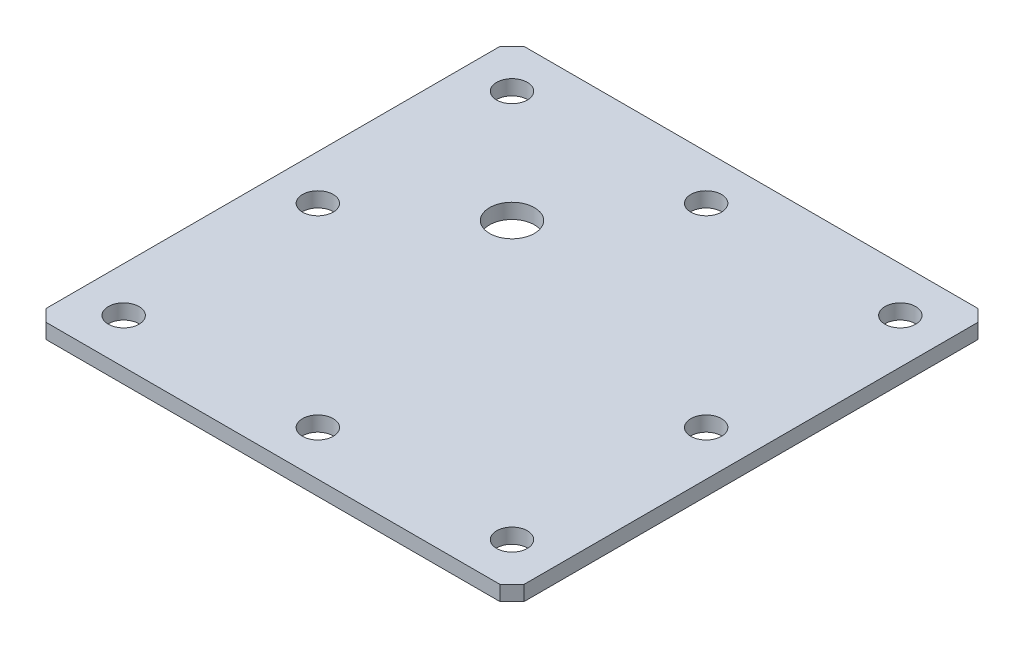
from build123d import *

# Parameters (mm, degrees)
SKETCH1_R           = 3.2639
SKETCH1_R_2         = 4.7625
BOSS_EXTRUDE1_DEPTH = 3.175


with BuildPart() as part:
    # Sketch1 → Boss-Extrude1 (new body)
    with BuildSketch(Plane(origin=(0, 0, 0), x_dir=(1, 0, 0), z_dir=(0, 1, 0))):
        Polygon((-49.428015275, 48.634177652), (-46.888015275, 51.174177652), (49.631984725, 51.174177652), (52.171984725, 48.634177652), (52.171984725, -47.885822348), (49.631984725, -50.425822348), (-46.888015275, -50.425822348), (-49.428015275, -47.885822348), align=None)
        with Locations(Location((-39.903015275, 41.649177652, 0), (0, 0, 270))):
            Circle(SKETCH1_R, mode=Mode.SUBTRACT)
        with Locations(Location((1.371984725, 41.649177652, 0), (0, 0, 270))):
            Circle(SKETCH1_R, mode=Mode.SUBTRACT)
        with Locations(Location((42.646984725, 41.649177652, 0), (0, 0, 270))):
            Circle(SKETCH1_R, mode=Mode.SUBTRACT)
        with Locations(Location((42.646984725, 0.374177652, 0), (0, 0, 270))):
            Circle(SKETCH1_R, mode=Mode.SUBTRACT)
        with Locations(Location((42.646984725, -40.900822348, 0), (0, 0, 270))):
            Circle(SKETCH1_R, mode=Mode.SUBTRACT)
        with Locations(Location((1.371984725, -40.900822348, 0), (0, 0, 270))):
            Circle(SKETCH1_R, mode=Mode.SUBTRACT)
        with Locations(Location((-39.903015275, -40.900822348, 0), (0, 0, 270))):
            Circle(SKETCH1_R, mode=Mode.SUBTRACT)
        with Locations(Location((-39.903015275, 0.374177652, 0), (0, 0, 270))):
            Circle(SKETCH1_R, mode=Mode.SUBTRACT)
        with Locations(Location((-16.090515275, 17.836677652, 0), (0, 0, 270))):
            Circle(SKETCH1_R_2, mode=Mode.SUBTRACT)
    extrude(amount=BOSS_EXTRUDE1_DEPTH)


solid = part.part
